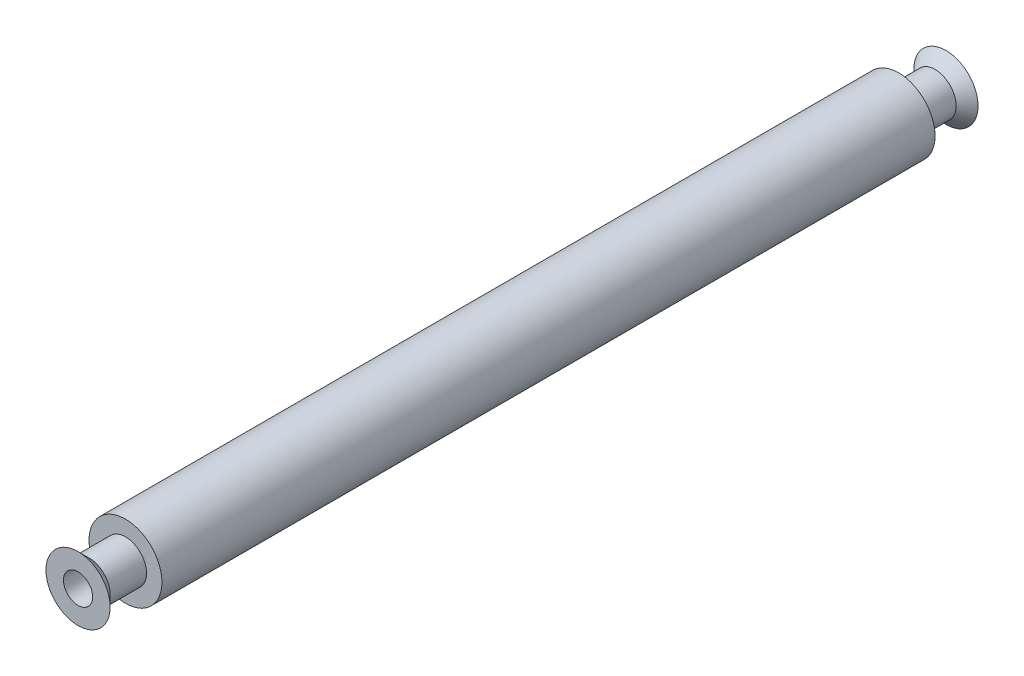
ISO-10303-21;
HEADER;
FILE_DESCRIPTION(('STEP AP214'),'2;1');
FILE_NAME('part.step','',(''),(''),'','','');
FILE_SCHEMA(('AUTOMOTIVE_DESIGN { 1 0 10303 214 1 1 1 1 }'));
ENDSEC;
DATA;
#1=APPLICATION_CONTEXT('core data for automotive mechanical design processes');
#2=APPLICATION_PROTOCOL_DEFINITION('international standard','automotive_design',2000,#1);
#3=PRODUCT_CONTEXT('',#1,'mechanical');
#4=PRODUCT('Part','Part','',(#3));
#5=PRODUCT_RELATED_PRODUCT_CATEGORY('part','',(#4));
#6=PRODUCT_DEFINITION_FORMATION('','',#4);
#7=PRODUCT_DEFINITION_CONTEXT('part definition',#1,'design');
#8=PRODUCT_DEFINITION('design','',#6,#7);
#9=PRODUCT_DEFINITION_SHAPE('','',#8);
#10=(LENGTH_UNIT() NAMED_UNIT(*) SI_UNIT(.MILLI.,.METRE.));
#11=(NAMED_UNIT(*) PLANE_ANGLE_UNIT() SI_UNIT($,.RADIAN.));
#12=(NAMED_UNIT(*) SI_UNIT($,.STERADIAN.) SOLID_ANGLE_UNIT());
#13=UNCERTAINTY_MEASURE_WITH_UNIT(LENGTH_MEASURE(1.E-05),#10,'distance_accuracy_value','');
#14=(GEOMETRIC_REPRESENTATION_CONTEXT(3) GLOBAL_UNCERTAINTY_ASSIGNED_CONTEXT((#13)) GLOBAL_UNIT_ASSIGNED_CONTEXT((#10,
#11,#12)) REPRESENTATION_CONTEXT('',''));
#15=CARTESIAN_POINT('',(0.,0.,0.));
#16=DIRECTION('',(0.,0.,1.));
#17=DIRECTION('',(1.,0.,0.));
#18=AXIS2_PLACEMENT_3D('',#15,#16,#17);
#19=CARTESIAN_POINT('',(0.,4.39575730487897,-6.50000000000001));
#20=DIRECTION('',(0.,0.,-1.));
#21=DIRECTION('',(1.,0.,0.));
#22=AXIS2_PLACEMENT_3D('',#19,#20,#21);
#23=PLANE('',#22);
#24=CARTESIAN_POINT('',(0.,0.,-6.50000000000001));
#25=DIRECTION('',(0.,0.,-1.));
#26=DIRECTION('',(-1.,0.,0.));
#27=AXIS2_PLACEMENT_3D('',#24,#25,#26);
#28=CIRCLE('',#27,4.39575730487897);
#29=CARTESIAN_POINT('',(-4.39575730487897,0.,-6.50000000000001));
#30=VERTEX_POINT('',#29);
#31=EDGE_CURVE('E68',#30,#30,#28,.T.);
#32=ORIENTED_EDGE('',*,*,#31,.T.);
#33=EDGE_LOOP('',(#32));
#34=FACE_BOUND('',#33,.T.);
#35=CARTESIAN_POINT('',(0.,0.,-6.50000000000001));
#36=DIRECTION('',(0.,0.,1.));
#37=DIRECTION('',(1.,0.,0.));
#38=AXIS2_PLACEMENT_3D('',#35,#36,#37);
#39=CIRCLE('',#38,2.);
#40=CARTESIAN_POINT('',(2.,0.,-6.50000000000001));
#41=VERTEX_POINT('',#40);
#42=EDGE_CURVE('E72',#41,#41,#39,.T.);
#43=ORIENTED_EDGE('',*,*,#42,.T.);
#44=EDGE_LOOP('',(#43));
#45=FACE_BOUND('',#44,.T.);
#46=ADVANCED_FACE('F33',(#34,#45),#23,.T.);
#47=CARTESIAN_POINT('',(0.,0.,106.));
#48=DIRECTION('',(0.,0.,-1.));
#49=DIRECTION('',(-1.,0.,0.));
#50=AXIS2_PLACEMENT_3D('',#47,#48,#49);
#51=CYLINDRICAL_SURFACE('',#50,5.);
#52=CARTESIAN_POINT('',(0.,0.,106.));
#53=DIRECTION('',(0.,0.,1.));
#54=DIRECTION('',(1.,0.,0.));
#55=AXIS2_PLACEMENT_3D('',#52,#53,#54);
#56=CIRCLE('',#55,5.);
#57=CARTESIAN_POINT('',(5.,0.,106.));
#58=VERTEX_POINT('',#57);
#59=EDGE_CURVE('E40',#58,#58,#56,.T.);
#60=ORIENTED_EDGE('',*,*,#59,.F.);
#61=EDGE_LOOP('',(#60));
#62=FACE_BOUND('',#61,.T.);
#63=CARTESIAN_POINT('',(0.,0.,0.));
#64=DIRECTION('',(0.,0.,1.));
#65=DIRECTION('',(1.,0.,0.));
#66=AXIS2_PLACEMENT_3D('',#63,#64,#65);
#67=CIRCLE('',#66,5.);
#68=CARTESIAN_POINT('',(5.,0.,0.));
#69=VERTEX_POINT('',#68);
#70=EDGE_CURVE('E44',#69,#69,#67,.T.);
#71=ORIENTED_EDGE('',*,*,#70,.T.);
#72=EDGE_LOOP('',(#71));
#73=FACE_BOUND('',#72,.T.);
#74=ADVANCED_FACE('F35',(#62,#73),#51,.T.);
#75=CARTESIAN_POINT('',(0.,0.,106.));
#76=DIRECTION('',(0.,0.,1.));
#77=DIRECTION('',(1.,0.,0.));
#78=AXIS2_PLACEMENT_3D('',#75,#76,#77);
#79=PLANE('',#78);
#80=CARTESIAN_POINT('',(0.,0.,106.));
#81=DIRECTION('',(0.,0.,1.));
#82=DIRECTION('',(1.,0.,0.));
#83=AXIS2_PLACEMENT_3D('',#80,#81,#82);
#84=CIRCLE('',#83,2.89575730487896);
#85=CARTESIAN_POINT('',(2.89575730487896,0.,106.));
#86=VERTEX_POINT('',#85);
#87=EDGE_CURVE('E10',#86,#86,#84,.T.);
#88=ORIENTED_EDGE('',*,*,#87,.F.);
#89=EDGE_LOOP('',(#88));
#90=FACE_BOUND('',#89,.T.);
#91=ORIENTED_EDGE('',*,*,#59,.T.);
#92=EDGE_LOOP('',(#91));
#93=FACE_BOUND('',#92,.T.);
#94=ADVANCED_FACE('F95',(#90,#93),#79,.T.);
#95=CARTESIAN_POINT('',(0.,0.,0.));
#96=DIRECTION('',(0.,0.,1.));
#97=DIRECTION('',(1.,0.,0.));
#98=AXIS2_PLACEMENT_3D('',#95,#96,#97);
#99=PLANE('',#98);
#100=CARTESIAN_POINT('',(0.,0.,0.));
#101=DIRECTION('',(0.,0.,-1.));
#102=DIRECTION('',(-1.,0.,0.));
#103=AXIS2_PLACEMENT_3D('',#100,#101,#102);
#104=CIRCLE('',#103,2.89575730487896);
#105=CARTESIAN_POINT('',(-2.89575730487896,0.,0.));
#106=VERTEX_POINT('',#105);
#107=EDGE_CURVE('E60',#106,#106,#104,.T.);
#108=ORIENTED_EDGE('',*,*,#107,.F.);
#109=EDGE_LOOP('',(#108));
#110=FACE_BOUND('',#109,.T.);
#111=ORIENTED_EDGE('',*,*,#70,.F.);
#112=EDGE_LOOP('',(#111));
#113=FACE_BOUND('',#112,.T.);
#114=ADVANCED_FACE('F125',(#110,#113),#99,.F.);
#115=CARTESIAN_POINT('',(0.,0.,0.));
#116=DIRECTION('',(0.,0.,-1.));
#117=DIRECTION('',(-1.,0.,0.));
#118=AXIS2_PLACEMENT_3D('',#115,#116,#117);
#119=CYLINDRICAL_SURFACE('',#118,2.89575730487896);
#120=CARTESIAN_POINT('',(0.,0.,111.));
#121=DIRECTION('',(0.,0.,-1.));
#122=DIRECTION('',(-1.,0.,0.));
#123=AXIS2_PLACEMENT_3D('',#120,#121,#122);
#124=CIRCLE('',#123,2.89575730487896);
#125=CARTESIAN_POINT('',(-2.89575730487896,0.,111.));
#126=VERTEX_POINT('',#125);
#127=EDGE_CURVE('E49',#126,#126,#124,.T.);
#128=ORIENTED_EDGE('',*,*,#127,.T.);
#129=EDGE_LOOP('',(#128));
#130=FACE_BOUND('',#129,.T.);
#131=ORIENTED_EDGE('',*,*,#87,.T.);
#132=EDGE_LOOP('',(#131));
#133=FACE_BOUND('',#132,.T.);
#134=ADVANCED_FACE('F121',(#130,#133),#119,.T.);
#135=CARTESIAN_POINT('',(0.,0.,111.));
#136=DIRECTION('',(0.,0.,1.));
#137=DIRECTION('',(1.,0.,0.));
#138=AXIS2_PLACEMENT_3D('',#135,#136,#137);
#139=CONICAL_SURFACE('',#138,2.89575730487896,0.785398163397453);
#140=CARTESIAN_POINT('',(0.,0.,112.5));
#141=DIRECTION('',(0.,0.,-1.));
#142=DIRECTION('',(-1.,0.,0.));
#143=AXIS2_PLACEMENT_3D('',#140,#141,#142);
#144=CIRCLE('',#143,4.39575730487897);
#145=CARTESIAN_POINT('',(-4.39575730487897,0.,112.5));
#146=VERTEX_POINT('',#145);
#147=EDGE_CURVE('E53',#146,#146,#144,.T.);
#148=ORIENTED_EDGE('',*,*,#147,.T.);
#149=EDGE_LOOP('',(#148));
#150=FACE_BOUND('',#149,.T.);
#151=ORIENTED_EDGE('',*,*,#127,.F.);
#152=EDGE_LOOP('',(#151));
#153=FACE_BOUND('',#152,.T.);
#154=ADVANCED_FACE('F117',(#150,#153),#139,.T.);
#155=CARTESIAN_POINT('',(0.,4.39575730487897,112.5));
#156=DIRECTION('',(0.,0.,1.));
#157=DIRECTION('',(1.,0.,0.));
#158=AXIS2_PLACEMENT_3D('',#155,#156,#157);
#159=PLANE('',#158);
#160=CARTESIAN_POINT('',(0.,0.,112.5));
#161=DIRECTION('',(0.,0.,1.));
#162=DIRECTION('',(1.,0.,0.));
#163=AXIS2_PLACEMENT_3D('',#160,#161,#162);
#164=CIRCLE('',#163,2.);
#165=CARTESIAN_POINT('',(2.,0.,112.5));
#166=VERTEX_POINT('',#165);
#167=EDGE_CURVE('E57',#166,#166,#164,.T.);
#168=ORIENTED_EDGE('',*,*,#167,.F.);
#169=EDGE_LOOP('',(#168));
#170=FACE_BOUND('',#169,.T.);
#171=ORIENTED_EDGE('',*,*,#147,.F.);
#172=EDGE_LOOP('',(#171));
#173=FACE_BOUND('',#172,.T.);
#174=ADVANCED_FACE('F113',(#170,#173),#159,.T.);
#175=CARTESIAN_POINT('',(0.,0.,108.5));
#176=DIRECTION('',(0.,0.,1.));
#177=DIRECTION('',(1.,0.,0.));
#178=AXIS2_PLACEMENT_3D('',#175,#176,#177);
#179=CYLINDRICAL_SURFACE('',#178,2.);
#180=CARTESIAN_POINT('',(0.,0.,108.5));
#181=DIRECTION('',(0.,0.,1.));
#182=DIRECTION('',(1.,0.,0.));
#183=AXIS2_PLACEMENT_3D('',#180,#181,#182);
#184=CIRCLE('',#183,2.);
#185=CARTESIAN_POINT('',(2.,0.,108.5));
#186=VERTEX_POINT('',#185);
#187=EDGE_CURVE('E56',#186,#186,#184,.T.);
#188=ORIENTED_EDGE('',*,*,#187,.F.);
#189=EDGE_LOOP('',(#188));
#190=FACE_BOUND('',#189,.T.);
#191=ORIENTED_EDGE('',*,*,#167,.T.);
#192=EDGE_LOOP('',(#191));
#193=FACE_BOUND('',#192,.T.);
#194=ADVANCED_FACE('F109',(#190,#193),#179,.F.);
#195=CARTESIAN_POINT('',(0.,0.,108.5));
#196=DIRECTION('',(0.,0.,1.));
#197=DIRECTION('',(1.,0.,0.));
#198=AXIS2_PLACEMENT_3D('',#195,#196,#197);
#199=PLANE('',#198);
#200=ORIENTED_EDGE('',*,*,#187,.T.);
#201=EDGE_LOOP('',(#200));
#202=FACE_BOUND('',#201,.T.);
#203=ADVANCED_FACE('F105',(#202),#199,.T.);
#204=CARTESIAN_POINT('',(0.,0.,106.));
#205=DIRECTION('',(0.,0.,1.));
#206=DIRECTION('',(-1.,0.,0.));
#207=AXIS2_PLACEMENT_3D('',#204,#205,#206);
#208=CYLINDRICAL_SURFACE('',#207,2.89575730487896);
#209=CARTESIAN_POINT('',(0.,0.,-5.));
#210=DIRECTION('',(0.,0.,-1.));
#211=DIRECTION('',(-1.,0.,0.));
#212=AXIS2_PLACEMENT_3D('',#209,#210,#211);
#213=CIRCLE('',#212,2.89575730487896);
#214=CARTESIAN_POINT('',(-2.89575730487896,0.,-5.));
#215=VERTEX_POINT('',#214);
#216=EDGE_CURVE('E65',#215,#215,#213,.T.);
#217=ORIENTED_EDGE('',*,*,#216,.F.);
#218=EDGE_LOOP('',(#217));
#219=FACE_BOUND('',#218,.T.);
#220=ORIENTED_EDGE('',*,*,#107,.T.);
#221=EDGE_LOOP('',(#220));
#222=FACE_BOUND('',#221,.T.);
#223=ADVANCED_FACE('F101',(#219,#222),#208,.T.);
#224=CARTESIAN_POINT('',(0.,0.,-5.));
#225=DIRECTION('',(0.,0.,-1.));
#226=DIRECTION('',(1.,0.,0.));
#227=AXIS2_PLACEMENT_3D('',#224,#225,#226);
#228=CONICAL_SURFACE('',#227,2.89575730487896,0.785398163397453);
#229=ORIENTED_EDGE('',*,*,#31,.F.);
#230=EDGE_LOOP('',(#229));
#231=FACE_BOUND('',#230,.T.);
#232=ORIENTED_EDGE('',*,*,#216,.T.);
#233=EDGE_LOOP('',(#232));
#234=FACE_BOUND('',#233,.T.);
#235=ADVANCED_FACE('F87',(#231,#234),#228,.T.);
#236=CARTESIAN_POINT('',(0.,0.,-2.50000000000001));
#237=DIRECTION('',(0.,0.,-1.));
#238=DIRECTION('',(-1.,0.,0.));
#239=AXIS2_PLACEMENT_3D('',#236,#237,#238);
#240=CYLINDRICAL_SURFACE('',#239,2.);
#241=CARTESIAN_POINT('',(0.,0.,-2.50000000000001));
#242=DIRECTION('',(0.,0.,1.));
#243=DIRECTION('',(1.,0.,0.));
#244=AXIS2_PLACEMENT_3D('',#241,#242,#243);
#245=CIRCLE('',#244,2.);
#246=CARTESIAN_POINT('',(2.,0.,-2.50000000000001));
#247=VERTEX_POINT('',#246);
#248=EDGE_CURVE('E71',#247,#247,#245,.T.);
#249=ORIENTED_EDGE('',*,*,#248,.T.);
#250=EDGE_LOOP('',(#249));
#251=FACE_BOUND('',#250,.T.);
#252=ORIENTED_EDGE('',*,*,#42,.F.);
#253=EDGE_LOOP('',(#252));
#254=FACE_BOUND('',#253,.T.);
#255=ADVANCED_FACE('F78',(#251,#254),#240,.F.);
#256=CARTESIAN_POINT('',(0.,0.,-2.50000000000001));
#257=DIRECTION('',(0.,0.,-1.));
#258=DIRECTION('',(1.,0.,0.));
#259=AXIS2_PLACEMENT_3D('',#256,#257,#258);
#260=PLANE('',#259);
#261=ORIENTED_EDGE('',*,*,#248,.F.);
#262=EDGE_LOOP('',(#261));
#263=FACE_BOUND('',#262,.T.);
#264=ADVANCED_FACE('F81',(#263),#260,.T.);
#265=CLOSED_SHELL('',(#46,#74,#94,#114,#134,#154,#174,#194,#203,#223,#235,#255,#264));
#266=MANIFOLD_SOLID_BREP('B2',#265);
#267=ADVANCED_BREP_SHAPE_REPRESENTATION('',(#18,#266),#14);
#268=SHAPE_DEFINITION_REPRESENTATION(#9,#267);
ENDSEC;
END-ISO-10303-21;
